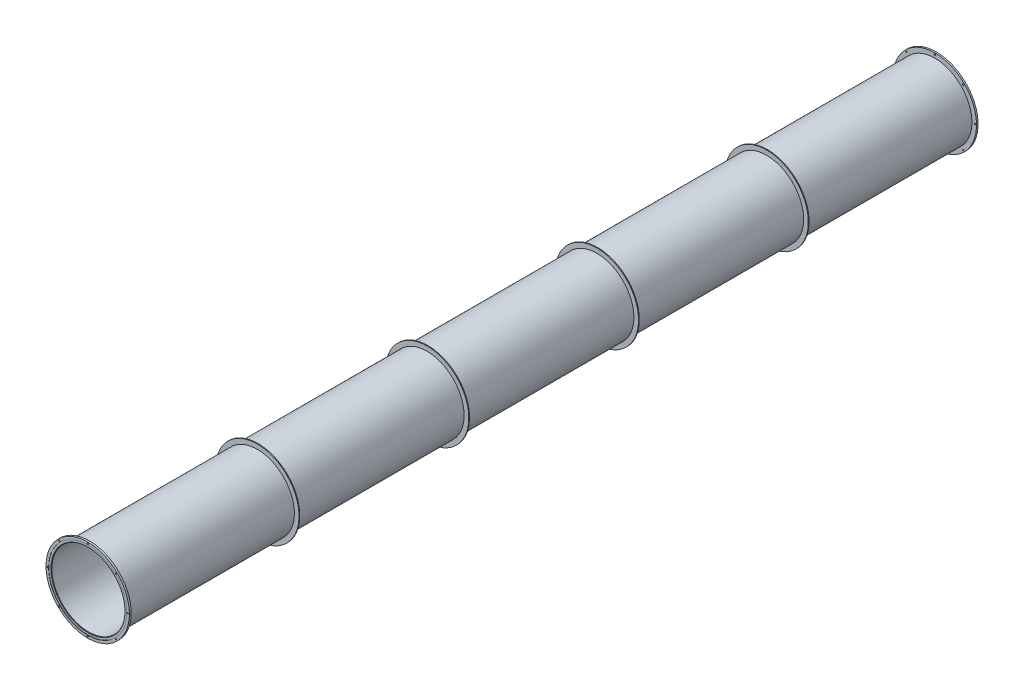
from build123d import *

# Parameters (mm, degrees)
F_7_8_0_875_DIAMETER_HOLE1_REACH  = 14010.377
F_7_8_0_875_DIAMETER_HOLE1_BORE_R = 11.1125
CIRPATTERN1_COUNT                 = 8
F_7_8_0_875_DIAMETER_HOLE2_REACH  = 14004.042
F_7_8_0_875_DIAMETER_HOLE2_BORE_R = 11.1125
CIRPATTERN2_COUNT                 = 8


with BuildPart() as part:
    # Sketch1 → Revolve1 (revolve)
    with BuildSketch(Plane(origin=(0, 0, 0), x_dir=(1, 0, 0), z_dir=(0, 1, 0)), mode=Mode.PRIVATE) as revolve1_sk:
        Polygon((603.25, 6975.475), (603.25, -6975.475), (609.6, -6981.825), (609.6, -6985), (642.9375, -6985), (642.9375, -6989.7625), (685.8, -6989.7625), (685.8, -6959.6), (609.6, -6959.6), (609.6, -4197.35), (685.8, -4197.35), (685.8, -4184.65), (609.6, -4184.65), (609.6, -1403.35), (685.8, -1403.35), (685.8, -1390.65), (609.6, -1390.65), (609.6, 1390.65), (685.8, 1390.65), (685.8, 1403.35), (609.6, 1403.35), (609.6, 4184.65), (685.8, 4184.65), (685.8, 4197.35), (609.6, 4197.35), (609.6, 6953.25), (685.8, 6953.25), (685.8, 6978.65), (641.35, 6978.65), (641.35, 6985), (632.449441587, 6985), (631.825, 6977.8626), (619.125, 6977.8626), (618.500558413, 6985), (609.6, 6985), (609.6, 6981.825), align=None)
    revolve(revolve1_sk.sketch.rotate(Axis((0, 0, -88.99), (0, 0, 1)), 180), axis=Axis((0, 0, -88.99), (0, 0, 1)))

    # 7_8 _0.875_ Diameter Hole1 bore → 7_8 _0.875_ Diameter Hole1 (cut, up to next)
    with BuildSketch(Plane.XY.offset(6989.7625), mode=Mode.PRIVATE) as f_7_8_0_875_diameter_hole1_sk1:
        with Locations((-660.4, 0)):
            Circle(F_7_8_0_875_DIAMETER_HOLE1_BORE_R)
    f_7_8_0_875_diameter_hole1_tool1 = extrude(f_7_8_0_875_diameter_hole1_sk1.sketch, amount=-F_7_8_0_875_DIAMETER_HOLE1_REACH, mode=Mode.PRIVATE) & part.part
    f_7_8_0_875_diameter_hole1 = f_7_8_0_875_diameter_hole1_tool1.solids().sort_by_distance((-660.4, 0, 6989.7625))[0]
    add(f_7_8_0_875_diameter_hole1, mode=Mode.SUBTRACT)

    # CirPattern1: 7_8 _0.875_ Diameter Hole1 ×8 about axis
    cirpattern1_axis = Axis((0, 0, 0), (0, 0, 1))
    for i in range(1, CIRPATTERN1_COUNT):
        add(f_7_8_0_875_diameter_hole1.rotate(cirpattern1_axis, i * 360 / CIRPATTERN1_COUNT), mode=Mode.SUBTRACT)

    # 7_8 _0.875_ Diameter Hole2 bore → 7_8 _0.875_ Diameter Hole2 (cut, up to next)
    with BuildSketch(Plane(origin=(0, 0, -6978.65), x_dir=(-1, 0, 0), z_dir=(0, 0, -1)), mode=Mode.PRIVATE) as f_7_8_0_875_diameter_hole2_sk1:
        with Locations((660.4, 0)):
            Circle(F_7_8_0_875_DIAMETER_HOLE2_BORE_R)
    f_7_8_0_875_diameter_hole2_tool1 = extrude(f_7_8_0_875_diameter_hole2_sk1.sketch, amount=-F_7_8_0_875_DIAMETER_HOLE2_REACH, mode=Mode.PRIVATE) & part.part
    f_7_8_0_875_diameter_hole2 = f_7_8_0_875_diameter_hole2_tool1.solids().sort_by_distance((-660.4, 0, -6978.65))[0]
    add(f_7_8_0_875_diameter_hole2, mode=Mode.SUBTRACT)

    # CirPattern2: 7_8 _0.875_ Diameter Hole2 ×8 about axis
    cirpattern2_axis = Axis((0, 0, 0), (0, 0, 1))
    for i in range(1, CIRPATTERN2_COUNT):
        add(f_7_8_0_875_diameter_hole2.rotate(cirpattern2_axis, i * 360 / CIRPATTERN2_COUNT), mode=Mode.SUBTRACT)


solid = part.part
